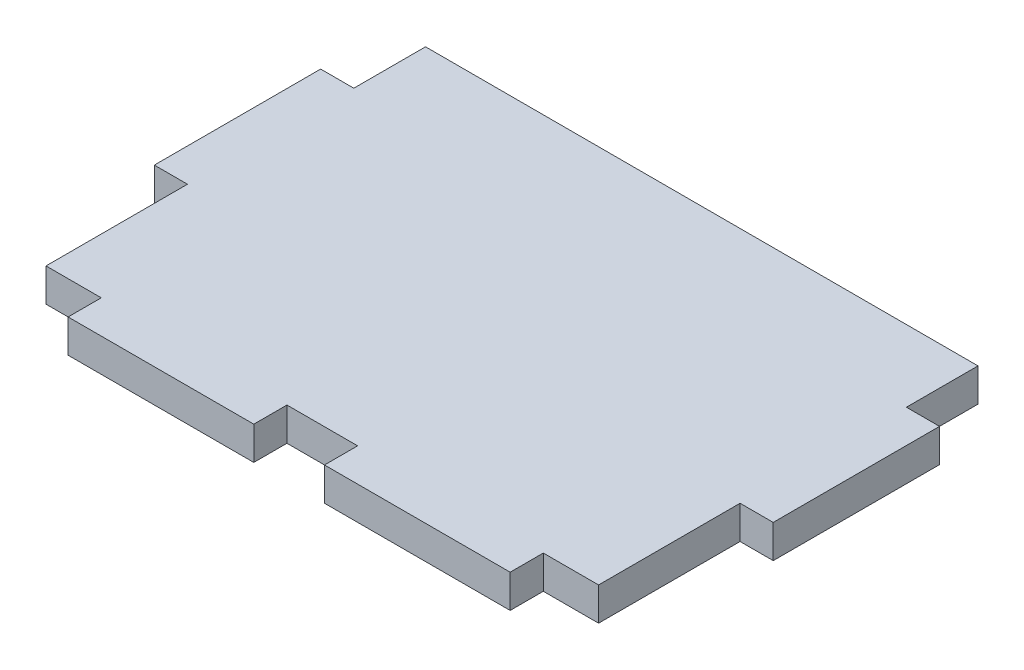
ISO-10303-21;
HEADER;
FILE_DESCRIPTION(('STEP AP214'),'2;1');
FILE_NAME('part.step','',(''),(''),'','','');
FILE_SCHEMA(('AUTOMOTIVE_DESIGN { 1 0 10303 214 1 1 1 1 }'));
ENDSEC;
DATA;
#1=APPLICATION_CONTEXT('core data for automotive mechanical design processes');
#2=APPLICATION_PROTOCOL_DEFINITION('international standard','automotive_design',2000,#1);
#3=PRODUCT_CONTEXT('',#1,'mechanical');
#4=PRODUCT('Part','Part','',(#3));
#5=PRODUCT_RELATED_PRODUCT_CATEGORY('part','',(#4));
#6=PRODUCT_DEFINITION_FORMATION('','',#4);
#7=PRODUCT_DEFINITION_CONTEXT('part definition',#1,'design');
#8=PRODUCT_DEFINITION('design','',#6,#7);
#9=PRODUCT_DEFINITION_SHAPE('','',#8);
#10=(LENGTH_UNIT() NAMED_UNIT(*) SI_UNIT(.MILLI.,.METRE.));
#11=(NAMED_UNIT(*) PLANE_ANGLE_UNIT() SI_UNIT($,.RADIAN.));
#12=(NAMED_UNIT(*) SI_UNIT($,.STERADIAN.) SOLID_ANGLE_UNIT());
#13=UNCERTAINTY_MEASURE_WITH_UNIT(LENGTH_MEASURE(1.E-05),#10,'distance_accuracy_value','');
#14=(GEOMETRIC_REPRESENTATION_CONTEXT(3) GLOBAL_UNCERTAINTY_ASSIGNED_CONTEXT((#13)) GLOBAL_UNIT_ASSIGNED_CONTEXT((#10,
#11,#12)) REPRESENTATION_CONTEXT('',''));
#15=CARTESIAN_POINT('',(0.,0.,0.));
#16=DIRECTION('',(0.,0.,1.));
#17=DIRECTION('',(1.,0.,0.));
#18=AXIS2_PLACEMENT_3D('',#15,#16,#17);
#19=CARTESIAN_POINT('',(-871.437806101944,3.,-447.227487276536));
#20=DIRECTION('',(0.,0.,-1.));
#21=DIRECTION('',(-1.,0.,0.));
#22=AXIS2_PLACEMENT_3D('',#19,#20,#21);
#23=PLANE('',#22);
#24=DIRECTION('',(1.,0.,0.));
#25=VECTOR('',#24,1.);
#26=CARTESIAN_POINT('',(-871.437806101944,0.,-447.227487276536));
#27=LINE('',#26,#25);
#28=CARTESIAN_POINT('',(-874.437806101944,0.,-447.227487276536));
#29=VERTEX_POINT('',#28);
#30=CARTESIAN_POINT('',(-871.437806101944,0.,-447.227487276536));
#31=VERTEX_POINT('',#30);
#32=EDGE_CURVE('E202',#29,#31,#27,.T.);
#33=ORIENTED_EDGE('',*,*,#32,.T.);
#34=DIRECTION('',(0.,-1.,0.));
#35=VECTOR('',#34,1.);
#36=CARTESIAN_POINT('',(-871.437806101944,3.,-447.227487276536));
#37=LINE('',#36,#35);
#38=CARTESIAN_POINT('',(-871.437806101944,3.,-447.227487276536));
#39=VERTEX_POINT('',#38);
#40=EDGE_CURVE('E11',#39,#31,#37,.T.);
#41=ORIENTED_EDGE('',*,*,#40,.F.);
#42=DIRECTION('',(1.,0.,0.));
#43=VECTOR('',#42,1.);
#44=CARTESIAN_POINT('',(-871.437806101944,3.,-447.227487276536));
#45=LINE('',#44,#43);
#46=CARTESIAN_POINT('',(-874.437806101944,3.,-447.227487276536));
#47=VERTEX_POINT('',#46);
#48=EDGE_CURVE('E240',#47,#39,#45,.T.);
#49=ORIENTED_EDGE('',*,*,#48,.F.);
#50=DIRECTION('',(0.,-1.,0.));
#51=VECTOR('',#50,1.);
#52=CARTESIAN_POINT('',(-874.437806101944,3.,-447.227487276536));
#53=LINE('',#52,#51);
#54=EDGE_CURVE('E198',#47,#29,#53,.T.);
#55=ORIENTED_EDGE('',*,*,#54,.T.);
#56=EDGE_LOOP('',(#33,#41,#49,#55));
#57=FACE_BOUND('',#56,.T.);
#58=ADVANCED_FACE('F34',(#57),#23,.F.);
#59=CARTESIAN_POINT('',(-871.437806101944,3.,-447.227487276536));
#60=DIRECTION('',(-1.,0.,0.));
#61=DIRECTION('',(0.,0.,1.));
#62=AXIS2_PLACEMENT_3D('',#59,#60,#61);
#63=PLANE('',#62);
#64=DIRECTION('',(0.,0.,-1.));
#65=VECTOR('',#64,1.);
#66=CARTESIAN_POINT('',(-871.437806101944,0.,-447.227487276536));
#67=LINE('',#66,#65);
#68=CARTESIAN_POINT('',(-871.437806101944,0.,-462.277187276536));
#69=VERTEX_POINT('',#68);
#70=EDGE_CURVE('E205',#31,#69,#67,.T.);
#71=ORIENTED_EDGE('',*,*,#70,.T.);
#72=DIRECTION('',(0.,-1.,0.));
#73=VECTOR('',#72,1.);
#74=CARTESIAN_POINT('',(-871.437806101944,3.,-462.277187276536));
#75=LINE('',#74,#73);
#76=CARTESIAN_POINT('',(-871.437806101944,3.,-462.277187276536));
#77=VERTEX_POINT('',#76);
#78=EDGE_CURVE('E42',#77,#69,#75,.T.);
#79=ORIENTED_EDGE('',*,*,#78,.F.);
#80=DIRECTION('',(0.,0.,-1.));
#81=VECTOR('',#80,1.);
#82=CARTESIAN_POINT('',(-871.437806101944,3.,-447.227487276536));
#83=LINE('',#82,#81);
#84=EDGE_CURVE('E129',#39,#77,#83,.T.);
#85=ORIENTED_EDGE('',*,*,#84,.F.);
#86=ORIENTED_EDGE('',*,*,#40,.T.);
#87=EDGE_LOOP('',(#71,#79,#85,#86));
#88=FACE_BOUND('',#87,.T.);
#89=ADVANCED_FACE('F358',(#88),#63,.F.);
#90=CARTESIAN_POINT('',(-874.437806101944,3.,-462.277187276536));
#91=DIRECTION('',(0.,0.,1.));
#92=DIRECTION('',(1.,0.,0.));
#93=AXIS2_PLACEMENT_3D('',#90,#91,#92);
#94=PLANE('',#93);
#95=DIRECTION('',(-1.,0.,0.));
#96=VECTOR('',#95,1.);
#97=CARTESIAN_POINT('',(-874.437806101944,0.,-462.277187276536));
#98=LINE('',#97,#96);
#99=CARTESIAN_POINT('',(-874.437806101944,0.,-462.277187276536));
#100=VERTEX_POINT('',#99);
#101=EDGE_CURVE('E207',#69,#100,#98,.T.);
#102=ORIENTED_EDGE('',*,*,#101,.T.);
#103=DIRECTION('',(0.,-1.,0.));
#104=VECTOR('',#103,1.);
#105=CARTESIAN_POINT('',(-874.437806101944,3.,-462.277187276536));
#106=LINE('',#105,#104);
#107=CARTESIAN_POINT('',(-874.437806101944,3.,-462.277187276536));
#108=VERTEX_POINT('',#107);
#109=EDGE_CURVE('E283',#108,#100,#106,.T.);
#110=ORIENTED_EDGE('',*,*,#109,.F.);
#111=DIRECTION('',(-1.,0.,0.));
#112=VECTOR('',#111,1.);
#113=CARTESIAN_POINT('',(-874.437806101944,3.,-462.277187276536));
#114=LINE('',#113,#112);
#115=EDGE_CURVE('E291',#77,#108,#114,.T.);
#116=ORIENTED_EDGE('',*,*,#115,.F.);
#117=ORIENTED_EDGE('',*,*,#78,.T.);
#118=EDGE_LOOP('',(#102,#110,#116,#117));
#119=FACE_BOUND('',#118,.T.);
#120=ADVANCED_FACE('F289',(#119),#94,.F.);
#121=CARTESIAN_POINT('',(-874.437806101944,3.,-468.757487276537));
#122=DIRECTION('',(-1.,0.,0.));
#123=DIRECTION('',(0.,0.,1.));
#124=AXIS2_PLACEMENT_3D('',#121,#122,#123);
#125=PLANE('',#124);
#126=DIRECTION('',(0.,0.,-1.));
#127=VECTOR('',#126,1.);
#128=CARTESIAN_POINT('',(-874.437806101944,0.,-468.757487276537));
#129=LINE('',#128,#127);
#130=CARTESIAN_POINT('',(-874.437806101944,0.,-468.757487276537));
#131=VERTEX_POINT('',#130);
#132=EDGE_CURVE('E209',#100,#131,#129,.T.);
#133=ORIENTED_EDGE('',*,*,#132,.T.);
#134=DIRECTION('',(0.,-1.,0.));
#135=VECTOR('',#134,1.);
#136=CARTESIAN_POINT('',(-874.437806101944,3.,-468.757487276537));
#137=LINE('',#136,#135);
#138=CARTESIAN_POINT('',(-874.437806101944,3.,-468.757487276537));
#139=VERTEX_POINT('',#138);
#140=EDGE_CURVE('E280',#139,#131,#137,.T.);
#141=ORIENTED_EDGE('',*,*,#140,.F.);
#142=DIRECTION('',(0.,0.,-1.));
#143=VECTOR('',#142,1.);
#144=CARTESIAN_POINT('',(-874.437806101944,3.,-468.757487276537));
#145=LINE('',#144,#143);
#146=EDGE_CURVE('E309',#108,#139,#145,.T.);
#147=ORIENTED_EDGE('',*,*,#146,.F.);
#148=ORIENTED_EDGE('',*,*,#109,.T.);
#149=EDGE_LOOP('',(#133,#141,#147,#148));
#150=FACE_BOUND('',#149,.T.);
#151=ADVANCED_FACE('F300',(#150),#125,.F.);
#152=CARTESIAN_POINT('',(-924.437806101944,3.,-468.767487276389));
#153=DIRECTION('',(-0.000199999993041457,0.,0.999999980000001));
#154=DIRECTION('',(0.999999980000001,0.,0.000199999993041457));
#155=AXIS2_PLACEMENT_3D('',#152,#153,#154);
#156=PLANE('',#155);
#157=DIRECTION('',(-0.999999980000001,0.,-0.000199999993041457));
#158=VECTOR('',#157,1.);
#159=CARTESIAN_POINT('',(-924.437806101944,0.,-468.767487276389));
#160=LINE('',#159,#158);
#161=CARTESIAN_POINT('',(-924.437806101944,0.,-468.767487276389));
#162=VERTEX_POINT('',#161);
#163=EDGE_CURVE('E211',#131,#162,#160,.T.);
#164=ORIENTED_EDGE('',*,*,#163,.T.);
#165=DIRECTION('',(0.,-1.,0.));
#166=VECTOR('',#165,1.);
#167=CARTESIAN_POINT('',(-924.437806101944,3.,-468.767487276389));
#168=LINE('',#167,#166);
#169=CARTESIAN_POINT('',(-924.437806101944,3.,-468.767487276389));
#170=VERTEX_POINT('',#169);
#171=EDGE_CURVE('E277',#170,#162,#168,.T.);
#172=ORIENTED_EDGE('',*,*,#171,.F.);
#173=DIRECTION('',(-0.999999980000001,0.,-0.000199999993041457));
#174=VECTOR('',#173,1.);
#175=CARTESIAN_POINT('',(-924.437806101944,3.,-468.767487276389));
#176=LINE('',#175,#174);
#177=EDGE_CURVE('E306',#139,#170,#176,.T.);
#178=ORIENTED_EDGE('',*,*,#177,.F.);
#179=ORIENTED_EDGE('',*,*,#140,.T.);
#180=EDGE_LOOP('',(#164,#172,#178,#179));
#181=FACE_BOUND('',#180,.T.);
#182=ADVANCED_FACE('F304',(#181),#156,.F.);
#183=CARTESIAN_POINT('',(-924.437806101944,3.,-468.767487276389));
#184=DIRECTION('',(1.,0.,0.));
#185=DIRECTION('',(0.,0.,-1.));
#186=AXIS2_PLACEMENT_3D('',#183,#184,#185);
#187=PLANE('',#186);
#188=DIRECTION('',(0.,0.,1.));
#189=VECTOR('',#188,1.);
#190=CARTESIAN_POINT('',(-924.437806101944,0.,-468.767487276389));
#191=LINE('',#190,#189);
#192=CARTESIAN_POINT('',(-924.437806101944,0.,-462.277187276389));
#193=VERTEX_POINT('',#192);
#194=EDGE_CURVE('E213',#162,#193,#191,.T.);
#195=ORIENTED_EDGE('',*,*,#194,.T.);
#196=DIRECTION('',(0.,-1.,0.));
#197=VECTOR('',#196,1.);
#198=CARTESIAN_POINT('',(-924.437806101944,3.,-462.277187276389));
#199=LINE('',#198,#197);
#200=CARTESIAN_POINT('',(-924.437806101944,3.,-462.277187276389));
#201=VERTEX_POINT('',#200);
#202=EDGE_CURVE('E274',#201,#193,#199,.T.);
#203=ORIENTED_EDGE('',*,*,#202,.F.);
#204=DIRECTION('',(0.,0.,1.));
#205=VECTOR('',#204,1.);
#206=CARTESIAN_POINT('',(-924.437806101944,3.,-468.767487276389));
#207=LINE('',#206,#205);
#208=EDGE_CURVE('E308',#170,#201,#207,.T.);
#209=ORIENTED_EDGE('',*,*,#208,.F.);
#210=ORIENTED_EDGE('',*,*,#171,.T.);
#211=EDGE_LOOP('',(#195,#203,#209,#210));
#212=FACE_BOUND('',#211,.T.);
#213=ADVANCED_FACE('F371',(#212),#187,.F.);
#214=CARTESIAN_POINT('',(-924.437806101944,3.,-462.277187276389));
#215=DIRECTION('',(0.,0.,1.));
#216=DIRECTION('',(1.,0.,0.));
#217=AXIS2_PLACEMENT_3D('',#214,#215,#216);
#218=PLANE('',#217);
#219=DIRECTION('',(-1.,0.,0.));
#220=VECTOR('',#219,1.);
#221=CARTESIAN_POINT('',(-924.437806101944,0.,-462.277187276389));
#222=LINE('',#221,#220);
#223=CARTESIAN_POINT('',(-927.437806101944,0.,-462.277187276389));
#224=VERTEX_POINT('',#223);
#225=EDGE_CURVE('E215',#193,#224,#222,.T.);
#226=ORIENTED_EDGE('',*,*,#225,.T.);
#227=DIRECTION('',(0.,-1.,0.));
#228=VECTOR('',#227,1.);
#229=CARTESIAN_POINT('',(-927.437806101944,3.,-462.277187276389));
#230=LINE('',#229,#228);
#231=CARTESIAN_POINT('',(-927.437806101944,3.,-462.277187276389));
#232=VERTEX_POINT('',#231);
#233=EDGE_CURVE('E271',#232,#224,#230,.T.);
#234=ORIENTED_EDGE('',*,*,#233,.F.);
#235=DIRECTION('',(-1.,0.,0.));
#236=VECTOR('',#235,1.);
#237=CARTESIAN_POINT('',(-924.437806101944,3.,-462.277187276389));
#238=LINE('',#237,#236);
#239=EDGE_CURVE('E311',#201,#232,#238,.T.);
#240=ORIENTED_EDGE('',*,*,#239,.F.);
#241=ORIENTED_EDGE('',*,*,#202,.T.);
#242=EDGE_LOOP('',(#226,#234,#240,#241));
#243=FACE_BOUND('',#242,.T.);
#244=ADVANCED_FACE('F374',(#243),#218,.F.);
#245=CARTESIAN_POINT('',(-927.437806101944,3.,-447.227487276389));
#246=DIRECTION('',(1.,0.,0.));
#247=DIRECTION('',(0.,0.,-1.));
#248=AXIS2_PLACEMENT_3D('',#245,#246,#247);
#249=PLANE('',#248);
#250=DIRECTION('',(0.,0.,1.));
#251=VECTOR('',#250,1.);
#252=CARTESIAN_POINT('',(-927.437806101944,0.,-447.227487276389));
#253=LINE('',#252,#251);
#254=CARTESIAN_POINT('',(-927.437806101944,0.,-447.227487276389));
#255=VERTEX_POINT('',#254);
#256=EDGE_CURVE('E217',#224,#255,#253,.T.);
#257=ORIENTED_EDGE('',*,*,#256,.T.);
#258=DIRECTION('',(0.,-1.,0.));
#259=VECTOR('',#258,1.);
#260=CARTESIAN_POINT('',(-927.437806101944,3.,-447.227487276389));
#261=LINE('',#260,#259);
#262=CARTESIAN_POINT('',(-927.437806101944,3.,-447.227487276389));
#263=VERTEX_POINT('',#262);
#264=EDGE_CURVE('E268',#263,#255,#261,.T.);
#265=ORIENTED_EDGE('',*,*,#264,.F.);
#266=DIRECTION('',(0.,0.,1.));
#267=VECTOR('',#266,1.);
#268=CARTESIAN_POINT('',(-927.437806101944,3.,-447.227487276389));
#269=LINE('',#268,#267);
#270=EDGE_CURVE('E317',#232,#263,#269,.T.);
#271=ORIENTED_EDGE('',*,*,#270,.F.);
#272=ORIENTED_EDGE('',*,*,#233,.T.);
#273=EDGE_LOOP('',(#257,#265,#271,#272));
#274=FACE_BOUND('',#273,.T.);
#275=ADVANCED_FACE('F378',(#274),#249,.F.);
#276=CARTESIAN_POINT('',(-927.437806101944,3.,-447.227487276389));
#277=DIRECTION('',(0.,0.,-1.));
#278=DIRECTION('',(-1.,0.,0.));
#279=AXIS2_PLACEMENT_3D('',#276,#277,#278);
#280=PLANE('',#279);
#281=DIRECTION('',(1.,0.,0.));
#282=VECTOR('',#281,1.);
#283=CARTESIAN_POINT('',(-927.437806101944,0.,-447.227487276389));
#284=LINE('',#283,#282);
#285=CARTESIAN_POINT('',(-924.437806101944,0.,-447.227487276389));
#286=VERTEX_POINT('',#285);
#287=EDGE_CURVE('E219',#255,#286,#284,.T.);
#288=ORIENTED_EDGE('',*,*,#287,.T.);
#289=DIRECTION('',(0.,-1.,0.));
#290=VECTOR('',#289,1.);
#291=CARTESIAN_POINT('',(-924.437806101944,3.,-447.227487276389));
#292=LINE('',#291,#290);
#293=CARTESIAN_POINT('',(-924.437806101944,3.,-447.227487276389));
#294=VERTEX_POINT('',#293);
#295=EDGE_CURVE('E265',#294,#286,#292,.T.);
#296=ORIENTED_EDGE('',*,*,#295,.F.);
#297=DIRECTION('',(1.,0.,0.));
#298=VECTOR('',#297,1.);
#299=CARTESIAN_POINT('',(-927.437806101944,3.,-447.227487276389));
#300=LINE('',#299,#298);
#301=EDGE_CURVE('E319',#263,#294,#300,.T.);
#302=ORIENTED_EDGE('',*,*,#301,.F.);
#303=ORIENTED_EDGE('',*,*,#264,.T.);
#304=EDGE_LOOP('',(#288,#296,#302,#303));
#305=FACE_BOUND('',#304,.T.);
#306=ADVANCED_FACE('F382',(#305),#280,.F.);
#307=CARTESIAN_POINT('',(-924.437806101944,3.,-447.227487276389));
#308=DIRECTION('',(1.,0.,0.));
#309=DIRECTION('',(0.,0.,-1.));
#310=AXIS2_PLACEMENT_3D('',#307,#308,#309);
#311=PLANE('',#310);
#312=DIRECTION('',(0.,0.,1.));
#313=VECTOR('',#312,1.);
#314=CARTESIAN_POINT('',(-924.437806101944,0.,-447.227487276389));
#315=LINE('',#314,#313);
#316=CARTESIAN_POINT('',(-924.437806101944,0.,-434.424887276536));
#317=VERTEX_POINT('',#316);
#318=EDGE_CURVE('E221',#286,#317,#315,.T.);
#319=ORIENTED_EDGE('',*,*,#318,.T.);
#320=DIRECTION('',(0.,-1.,0.));
#321=VECTOR('',#320,1.);
#322=CARTESIAN_POINT('',(-924.437806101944,3.,-434.424887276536));
#323=LINE('',#322,#321);
#324=CARTESIAN_POINT('',(-924.437806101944,3.,-434.424887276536));
#325=VERTEX_POINT('',#324);
#326=EDGE_CURVE('E262',#325,#317,#323,.T.);
#327=ORIENTED_EDGE('',*,*,#326,.F.);
#328=DIRECTION('',(0.,0.,1.));
#329=VECTOR('',#328,1.);
#330=CARTESIAN_POINT('',(-924.437806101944,3.,-447.227487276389));
#331=LINE('',#330,#329);
#332=EDGE_CURVE('E321',#294,#325,#331,.T.);
#333=ORIENTED_EDGE('',*,*,#332,.F.);
#334=ORIENTED_EDGE('',*,*,#295,.T.);
#335=EDGE_LOOP('',(#319,#327,#333,#334));
#336=FACE_BOUND('',#335,.T.);
#337=ADVANCED_FACE('F386',(#336),#311,.F.);
#338=CARTESIAN_POINT('',(-924.437806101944,3.,-434.424887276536));
#339=DIRECTION('',(0.,0.,-1.));
#340=DIRECTION('',(-1.,0.,0.));
#341=AXIS2_PLACEMENT_3D('',#338,#339,#340);
#342=PLANE('',#341);
#343=DIRECTION('',(1.,0.,0.));
#344=VECTOR('',#343,1.);
#345=CARTESIAN_POINT('',(-924.437806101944,0.,-434.424887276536));
#346=LINE('',#345,#344);
#347=CARTESIAN_POINT('',(-919.437806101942,0.,-434.424887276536));
#348=VERTEX_POINT('',#347);
#349=EDGE_CURVE('E223',#317,#348,#346,.T.);
#350=ORIENTED_EDGE('',*,*,#349,.T.);
#351=DIRECTION('',(0.,-1.,0.));
#352=VECTOR('',#351,1.);
#353=CARTESIAN_POINT('',(-919.437806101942,3.,-434.424887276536));
#354=LINE('',#353,#352);
#355=CARTESIAN_POINT('',(-919.437806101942,3.,-434.424887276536));
#356=VERTEX_POINT('',#355);
#357=EDGE_CURVE('E259',#356,#348,#354,.T.);
#358=ORIENTED_EDGE('',*,*,#357,.F.);
#359=DIRECTION('',(1.,0.,0.));
#360=VECTOR('',#359,1.);
#361=CARTESIAN_POINT('',(-924.437806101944,3.,-434.424887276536));
#362=LINE('',#361,#360);
#363=EDGE_CURVE('E323',#325,#356,#362,.T.);
#364=ORIENTED_EDGE('',*,*,#363,.F.);
#365=ORIENTED_EDGE('',*,*,#326,.T.);
#366=EDGE_LOOP('',(#350,#358,#364,#365));
#367=FACE_BOUND('',#366,.T.);
#368=ADVANCED_FACE('F390',(#367),#342,.F.);
#369=CARTESIAN_POINT('',(-919.437806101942,3.,-434.424887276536));
#370=DIRECTION('',(1.,0.,0.));
#371=DIRECTION('',(0.,0.,-1.));
#372=AXIS2_PLACEMENT_3D('',#369,#370,#371);
#373=PLANE('',#372);
#374=DIRECTION('',(0.,0.,1.));
#375=VECTOR('',#374,1.);
#376=CARTESIAN_POINT('',(-919.437806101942,0.,-434.424887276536));
#377=LINE('',#376,#375);
#378=CARTESIAN_POINT('',(-919.437806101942,0.,-431.424887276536));
#379=VERTEX_POINT('',#378);
#380=EDGE_CURVE('E225',#348,#379,#377,.T.);
#381=ORIENTED_EDGE('',*,*,#380,.T.);
#382=DIRECTION('',(0.,-1.,0.));
#383=VECTOR('',#382,1.);
#384=CARTESIAN_POINT('',(-919.437806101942,3.,-431.424887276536));
#385=LINE('',#384,#383);
#386=CARTESIAN_POINT('',(-919.437806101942,3.,-431.424887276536));
#387=VERTEX_POINT('',#386);
#388=EDGE_CURVE('E256',#387,#379,#385,.T.);
#389=ORIENTED_EDGE('',*,*,#388,.F.);
#390=DIRECTION('',(0.,0.,1.));
#391=VECTOR('',#390,1.);
#392=CARTESIAN_POINT('',(-919.437806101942,3.,-434.424887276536));
#393=LINE('',#392,#391);
#394=EDGE_CURVE('E325',#356,#387,#393,.T.);
#395=ORIENTED_EDGE('',*,*,#394,.F.);
#396=ORIENTED_EDGE('',*,*,#357,.T.);
#397=EDGE_LOOP('',(#381,#389,#395,#396));
#398=FACE_BOUND('',#397,.T.);
#399=ADVANCED_FACE('F394',(#398),#373,.F.);
#400=CARTESIAN_POINT('',(-919.437806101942,3.,-431.424887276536));
#401=DIRECTION('',(0.,0.,-1.));
#402=DIRECTION('',(-1.,0.,0.));
#403=AXIS2_PLACEMENT_3D('',#400,#401,#402);
#404=PLANE('',#403);
#405=DIRECTION('',(1.,0.,0.));
#406=VECTOR('',#405,1.);
#407=CARTESIAN_POINT('',(-919.437806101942,0.,-431.424887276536));
#408=LINE('',#407,#406);
#409=CARTESIAN_POINT('',(-902.635539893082,0.,-431.424887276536));
#410=VERTEX_POINT('',#409);
#411=EDGE_CURVE('E227',#379,#410,#408,.T.);
#412=ORIENTED_EDGE('',*,*,#411,.T.);
#413=DIRECTION('',(0.,-1.,0.));
#414=VECTOR('',#413,1.);
#415=CARTESIAN_POINT('',(-902.635539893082,3.,-431.424887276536));
#416=LINE('',#415,#414);
#417=CARTESIAN_POINT('',(-902.635539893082,3.,-431.424887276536));
#418=VERTEX_POINT('',#417);
#419=EDGE_CURVE('E253',#418,#410,#416,.T.);
#420=ORIENTED_EDGE('',*,*,#419,.F.);
#421=DIRECTION('',(1.,0.,0.));
#422=VECTOR('',#421,1.);
#423=CARTESIAN_POINT('',(-919.437806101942,3.,-431.424887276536));
#424=LINE('',#423,#422);
#425=EDGE_CURVE('E327',#387,#418,#424,.T.);
#426=ORIENTED_EDGE('',*,*,#425,.F.);
#427=ORIENTED_EDGE('',*,*,#388,.T.);
#428=EDGE_LOOP('',(#412,#420,#426,#427));
#429=FACE_BOUND('',#428,.T.);
#430=ADVANCED_FACE('F398',(#429),#404,.F.);
#431=CARTESIAN_POINT('',(-902.635539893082,3.,-431.424887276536));
#432=DIRECTION('',(-1.,0.,0.));
#433=DIRECTION('',(0.,0.,1.));
#434=AXIS2_PLACEMENT_3D('',#431,#432,#433);
#435=PLANE('',#434);
#436=DIRECTION('',(0.,0.,-1.));
#437=VECTOR('',#436,1.);
#438=CARTESIAN_POINT('',(-902.635539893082,0.,-431.424887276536));
#439=LINE('',#438,#437);
#440=CARTESIAN_POINT('',(-902.635539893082,0.,-434.424887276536));
#441=VERTEX_POINT('',#440);
#442=EDGE_CURVE('E229',#410,#441,#439,.T.);
#443=ORIENTED_EDGE('',*,*,#442,.T.);
#444=DIRECTION('',(0.,-1.,0.));
#445=VECTOR('',#444,1.);
#446=CARTESIAN_POINT('',(-902.635539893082,3.,-434.424887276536));
#447=LINE('',#446,#445);
#448=CARTESIAN_POINT('',(-902.635539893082,3.,-434.424887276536));
#449=VERTEX_POINT('',#448);
#450=EDGE_CURVE('E250',#449,#441,#447,.T.);
#451=ORIENTED_EDGE('',*,*,#450,.F.);
#452=DIRECTION('',(0.,0.,-1.));
#453=VECTOR('',#452,1.);
#454=CARTESIAN_POINT('',(-902.635539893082,3.,-431.424887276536));
#455=LINE('',#454,#453);
#456=EDGE_CURVE('E329',#418,#449,#455,.T.);
#457=ORIENTED_EDGE('',*,*,#456,.F.);
#458=ORIENTED_EDGE('',*,*,#419,.T.);
#459=EDGE_LOOP('',(#443,#451,#457,#458));
#460=FACE_BOUND('',#459,.T.);
#461=ADVANCED_FACE('F402',(#460),#435,.F.);
#462=CARTESIAN_POINT('',(-902.635539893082,3.,-434.424887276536));
#463=DIRECTION('',(0.,0.,-1.));
#464=DIRECTION('',(-1.,0.,0.));
#465=AXIS2_PLACEMENT_3D('',#462,#463,#464);
#466=PLANE('',#465);
#467=DIRECTION('',(1.,0.,0.));
#468=VECTOR('',#467,1.);
#469=CARTESIAN_POINT('',(-902.635539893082,0.,-434.424887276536));
#470=LINE('',#469,#468);
#471=CARTESIAN_POINT('',(-896.240072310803,0.,-434.424887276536));
#472=VERTEX_POINT('',#471);
#473=EDGE_CURVE('E231',#441,#472,#470,.T.);
#474=ORIENTED_EDGE('',*,*,#473,.T.);
#475=DIRECTION('',(0.,-1.,0.));
#476=VECTOR('',#475,1.);
#477=CARTESIAN_POINT('',(-896.240072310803,3.,-434.424887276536));
#478=LINE('',#477,#476);
#479=CARTESIAN_POINT('',(-896.240072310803,3.,-434.424887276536));
#480=VERTEX_POINT('',#479);
#481=EDGE_CURVE('E247',#480,#472,#478,.T.);
#482=ORIENTED_EDGE('',*,*,#481,.F.);
#483=DIRECTION('',(1.,0.,0.));
#484=VECTOR('',#483,1.);
#485=CARTESIAN_POINT('',(-902.635539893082,3.,-434.424887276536));
#486=LINE('',#485,#484);
#487=EDGE_CURVE('E331',#449,#480,#486,.T.);
#488=ORIENTED_EDGE('',*,*,#487,.F.);
#489=ORIENTED_EDGE('',*,*,#450,.T.);
#490=EDGE_LOOP('',(#474,#482,#488,#489));
#491=FACE_BOUND('',#490,.T.);
#492=ADVANCED_FACE('F406',(#491),#466,.F.);
#493=CARTESIAN_POINT('',(-896.240072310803,3.,-434.424887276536));
#494=DIRECTION('',(1.,0.,0.));
#495=DIRECTION('',(0.,0.,-1.));
#496=AXIS2_PLACEMENT_3D('',#493,#494,#495);
#497=PLANE('',#496);
#498=DIRECTION('',(0.,0.,1.));
#499=VECTOR('',#498,1.);
#500=CARTESIAN_POINT('',(-896.240072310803,0.,-434.424887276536));
#501=LINE('',#500,#499);
#502=CARTESIAN_POINT('',(-896.240072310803,0.,-431.424887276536));
#503=VERTEX_POINT('',#502);
#504=EDGE_CURVE('E233',#472,#503,#501,.T.);
#505=ORIENTED_EDGE('',*,*,#504,.T.);
#506=DIRECTION('',(0.,-1.,0.));
#507=VECTOR('',#506,1.);
#508=CARTESIAN_POINT('',(-896.240072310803,3.,-431.424887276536));
#509=LINE('',#508,#507);
#510=CARTESIAN_POINT('',(-896.240072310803,3.,-431.424887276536));
#511=VERTEX_POINT('',#510);
#512=EDGE_CURVE('E244',#511,#503,#509,.T.);
#513=ORIENTED_EDGE('',*,*,#512,.F.);
#514=DIRECTION('',(0.,0.,1.));
#515=VECTOR('',#514,1.);
#516=CARTESIAN_POINT('',(-896.240072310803,3.,-434.424887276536));
#517=LINE('',#516,#515);
#518=EDGE_CURVE('E333',#480,#511,#517,.T.);
#519=ORIENTED_EDGE('',*,*,#518,.F.);
#520=ORIENTED_EDGE('',*,*,#481,.T.);
#521=EDGE_LOOP('',(#505,#513,#519,#520));
#522=FACE_BOUND('',#521,.T.);
#523=ADVANCED_FACE('F339',(#522),#497,.F.);
#524=CARTESIAN_POINT('',(-896.240072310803,3.,-431.424887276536));
#525=DIRECTION('',(0.,0.,-1.));
#526=DIRECTION('',(-1.,0.,0.));
#527=AXIS2_PLACEMENT_3D('',#524,#525,#526);
#528=PLANE('',#527);
#529=DIRECTION('',(1.,0.,0.));
#530=VECTOR('',#529,1.);
#531=CARTESIAN_POINT('',(-896.240072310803,0.,-431.424887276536));
#532=LINE('',#531,#530);
#533=CARTESIAN_POINT('',(-879.437806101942,0.,-431.424887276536));
#534=VERTEX_POINT('',#533);
#535=EDGE_CURVE('E235',#503,#534,#532,.T.);
#536=ORIENTED_EDGE('',*,*,#535,.T.);
#537=DIRECTION('',(0.,-1.,0.));
#538=VECTOR('',#537,1.);
#539=CARTESIAN_POINT('',(-879.437806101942,3.,-431.424887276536));
#540=LINE('',#539,#538);
#541=CARTESIAN_POINT('',(-879.437806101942,3.,-431.424887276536));
#542=VERTEX_POINT('',#541);
#543=EDGE_CURVE('E193',#542,#534,#540,.T.);
#544=ORIENTED_EDGE('',*,*,#543,.F.);
#545=DIRECTION('',(1.,0.,0.));
#546=VECTOR('',#545,1.);
#547=CARTESIAN_POINT('',(-896.240072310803,3.,-431.424887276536));
#548=LINE('',#547,#546);
#549=EDGE_CURVE('E184',#511,#542,#548,.T.);
#550=ORIENTED_EDGE('',*,*,#549,.F.);
#551=ORIENTED_EDGE('',*,*,#512,.T.);
#552=EDGE_LOOP('',(#536,#544,#550,#551));
#553=FACE_BOUND('',#552,.T.);
#554=ADVANCED_FACE('F343',(#553),#528,.F.);
#555=CARTESIAN_POINT('',(-879.437806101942,3.,-431.424887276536));
#556=DIRECTION('',(-1.,0.,0.));
#557=DIRECTION('',(0.,0.,1.));
#558=AXIS2_PLACEMENT_3D('',#555,#556,#557);
#559=PLANE('',#558);
#560=DIRECTION('',(0.,0.,-1.));
#561=VECTOR('',#560,1.);
#562=CARTESIAN_POINT('',(-879.437806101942,0.,-431.424887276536));
#563=LINE('',#562,#561);
#564=CARTESIAN_POINT('',(-879.437806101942,0.,-434.424887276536));
#565=VERTEX_POINT('',#564);
#566=EDGE_CURVE('E192',#534,#565,#563,.T.);
#567=ORIENTED_EDGE('',*,*,#566,.T.);
#568=DIRECTION('',(0.,-1.,0.));
#569=VECTOR('',#568,1.);
#570=CARTESIAN_POINT('',(-879.437806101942,3.,-434.424887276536));
#571=LINE('',#570,#569);
#572=CARTESIAN_POINT('',(-879.437806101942,3.,-434.424887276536));
#573=VERTEX_POINT('',#572);
#574=EDGE_CURVE('E189',#573,#565,#571,.T.);
#575=ORIENTED_EDGE('',*,*,#574,.F.);
#576=DIRECTION('',(0.,0.,-1.));
#577=VECTOR('',#576,1.);
#578=CARTESIAN_POINT('',(-879.437806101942,3.,-431.424887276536));
#579=LINE('',#578,#577);
#580=EDGE_CURVE('E178',#542,#573,#579,.T.);
#581=ORIENTED_EDGE('',*,*,#580,.F.);
#582=ORIENTED_EDGE('',*,*,#543,.T.);
#583=EDGE_LOOP('',(#567,#575,#581,#582));
#584=FACE_BOUND('',#583,.T.);
#585=ADVANCED_FACE('F190',(#584),#559,.F.);
#586=CARTESIAN_POINT('',(-879.437806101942,3.,-434.424887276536));
#587=DIRECTION('',(0.,0.,-1.));
#588=DIRECTION('',(-1.,0.,0.));
#589=AXIS2_PLACEMENT_3D('',#586,#587,#588);
#590=PLANE('',#589);
#591=DIRECTION('',(1.,0.,0.));
#592=VECTOR('',#591,1.);
#593=CARTESIAN_POINT('',(-879.437806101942,0.,-434.424887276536));
#594=LINE('',#593,#592);
#595=CARTESIAN_POINT('',(-874.437806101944,0.,-434.424887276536));
#596=VERTEX_POINT('',#595);
#597=EDGE_CURVE('E115',#565,#596,#594,.T.);
#598=ORIENTED_EDGE('',*,*,#597,.T.);
#599=DIRECTION('',(0.,-1.,0.));
#600=VECTOR('',#599,1.);
#601=CARTESIAN_POINT('',(-874.437806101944,3.,-434.424887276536));
#602=LINE('',#601,#600);
#603=CARTESIAN_POINT('',(-874.437806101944,3.,-434.424887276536));
#604=VERTEX_POINT('',#603);
#605=EDGE_CURVE('E194',#604,#596,#602,.T.);
#606=ORIENTED_EDGE('',*,*,#605,.F.);
#607=DIRECTION('',(1.,0.,0.));
#608=VECTOR('',#607,1.);
#609=CARTESIAN_POINT('',(-879.437806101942,3.,-434.424887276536));
#610=LINE('',#609,#608);
#611=EDGE_CURVE('E182',#573,#604,#610,.T.);
#612=ORIENTED_EDGE('',*,*,#611,.F.);
#613=ORIENTED_EDGE('',*,*,#574,.T.);
#614=EDGE_LOOP('',(#598,#606,#612,#613));
#615=FACE_BOUND('',#614,.T.);
#616=ADVANCED_FACE('F196',(#615),#590,.F.);
#617=CARTESIAN_POINT('',(-874.437806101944,3.,-447.227487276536));
#618=DIRECTION('',(-1.,0.,0.));
#619=DIRECTION('',(0.,0.,1.));
#620=AXIS2_PLACEMENT_3D('',#617,#618,#619);
#621=PLANE('',#620);
#622=DIRECTION('',(0.,0.,-1.));
#623=VECTOR('',#622,1.);
#624=CARTESIAN_POINT('',(-874.437806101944,0.,-447.227487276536));
#625=LINE('',#624,#623);
#626=EDGE_CURVE('E121',#596,#29,#625,.T.);
#627=ORIENTED_EDGE('',*,*,#626,.T.);
#628=ORIENTED_EDGE('',*,*,#54,.F.);
#629=DIRECTION('',(0.,0.,-1.));
#630=VECTOR('',#629,1.);
#631=CARTESIAN_POINT('',(-874.437806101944,3.,-447.227487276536));
#632=LINE('',#631,#630);
#633=EDGE_CURVE('E50',#604,#47,#632,.T.);
#634=ORIENTED_EDGE('',*,*,#633,.F.);
#635=ORIENTED_EDGE('',*,*,#605,.T.);
#636=EDGE_LOOP('',(#627,#628,#634,#635));
#637=FACE_BOUND('',#636,.T.);
#638=ADVANCED_FACE('F347',(#637),#621,.F.);
#639=CARTESIAN_POINT('',(0.,3.,0.));
#640=DIRECTION('',(0.,1.,0.));
#641=DIRECTION('',(0.,0.,1.));
#642=AXIS2_PLACEMENT_3D('',#639,#640,#641);
#643=PLANE('',#642);
#644=ORIENTED_EDGE('',*,*,#48,.T.);
#645=ORIENTED_EDGE('',*,*,#84,.T.);
#646=ORIENTED_EDGE('',*,*,#115,.T.);
#647=ORIENTED_EDGE('',*,*,#146,.T.);
#648=ORIENTED_EDGE('',*,*,#177,.T.);
#649=ORIENTED_EDGE('',*,*,#208,.T.);
#650=ORIENTED_EDGE('',*,*,#239,.T.);
#651=ORIENTED_EDGE('',*,*,#270,.T.);
#652=ORIENTED_EDGE('',*,*,#301,.T.);
#653=ORIENTED_EDGE('',*,*,#332,.T.);
#654=ORIENTED_EDGE('',*,*,#363,.T.);
#655=ORIENTED_EDGE('',*,*,#394,.T.);
#656=ORIENTED_EDGE('',*,*,#425,.T.);
#657=ORIENTED_EDGE('',*,*,#456,.T.);
#658=ORIENTED_EDGE('',*,*,#487,.T.);
#659=ORIENTED_EDGE('',*,*,#518,.T.);
#660=ORIENTED_EDGE('',*,*,#549,.T.);
#661=ORIENTED_EDGE('',*,*,#580,.T.);
#662=ORIENTED_EDGE('',*,*,#611,.T.);
#663=ORIENTED_EDGE('',*,*,#633,.T.);
#664=EDGE_LOOP('',(#644,#645,#646,#647,#648,#649,#650,#651,#652,#653,#654,#655,#656,#657,#658,
#659,#660,#661,#662,#663));
#665=FACE_BOUND('',#664,.T.);
#666=ADVANCED_FACE('F180',(#665),#643,.T.);
#667=CARTESIAN_POINT('',(0.,0.,0.));
#668=DIRECTION('',(0.,1.,0.));
#669=DIRECTION('',(0.,0.,1.));
#670=AXIS2_PLACEMENT_3D('',#667,#668,#669);
#671=PLANE('',#670);
#672=ORIENTED_EDGE('',*,*,#32,.F.);
#673=ORIENTED_EDGE('',*,*,#626,.F.);
#674=ORIENTED_EDGE('',*,*,#597,.F.);
#675=ORIENTED_EDGE('',*,*,#566,.F.);
#676=ORIENTED_EDGE('',*,*,#535,.F.);
#677=ORIENTED_EDGE('',*,*,#504,.F.);
#678=ORIENTED_EDGE('',*,*,#473,.F.);
#679=ORIENTED_EDGE('',*,*,#442,.F.);
#680=ORIENTED_EDGE('',*,*,#411,.F.);
#681=ORIENTED_EDGE('',*,*,#380,.F.);
#682=ORIENTED_EDGE('',*,*,#349,.F.);
#683=ORIENTED_EDGE('',*,*,#318,.F.);
#684=ORIENTED_EDGE('',*,*,#287,.F.);
#685=ORIENTED_EDGE('',*,*,#256,.F.);
#686=ORIENTED_EDGE('',*,*,#225,.F.);
#687=ORIENTED_EDGE('',*,*,#194,.F.);
#688=ORIENTED_EDGE('',*,*,#163,.F.);
#689=ORIENTED_EDGE('',*,*,#132,.F.);
#690=ORIENTED_EDGE('',*,*,#101,.F.);
#691=ORIENTED_EDGE('',*,*,#70,.F.);
#692=EDGE_LOOP('',(#672,#673,#674,#675,#676,#677,#678,#679,#680,#681,#682,#683,#684,#685,#686,
#687,#688,#689,#690,#691));
#693=FACE_BOUND('',#692,.T.);
#694=ADVANCED_FACE('F295',(#693),#671,.F.);
#695=CLOSED_SHELL('',(#58,#89,#120,#151,#182,#213,#244,#275,#306,#337,#368,#399,#430,#461,#492,
#523,#554,#585,#616,#638,#666,#694));
#696=MANIFOLD_SOLID_BREP('B2',#695);
#697=ADVANCED_BREP_SHAPE_REPRESENTATION('',(#18,#696),#14);
#698=SHAPE_DEFINITION_REPRESENTATION(#9,#697);
ENDSEC;
END-ISO-10303-21;
